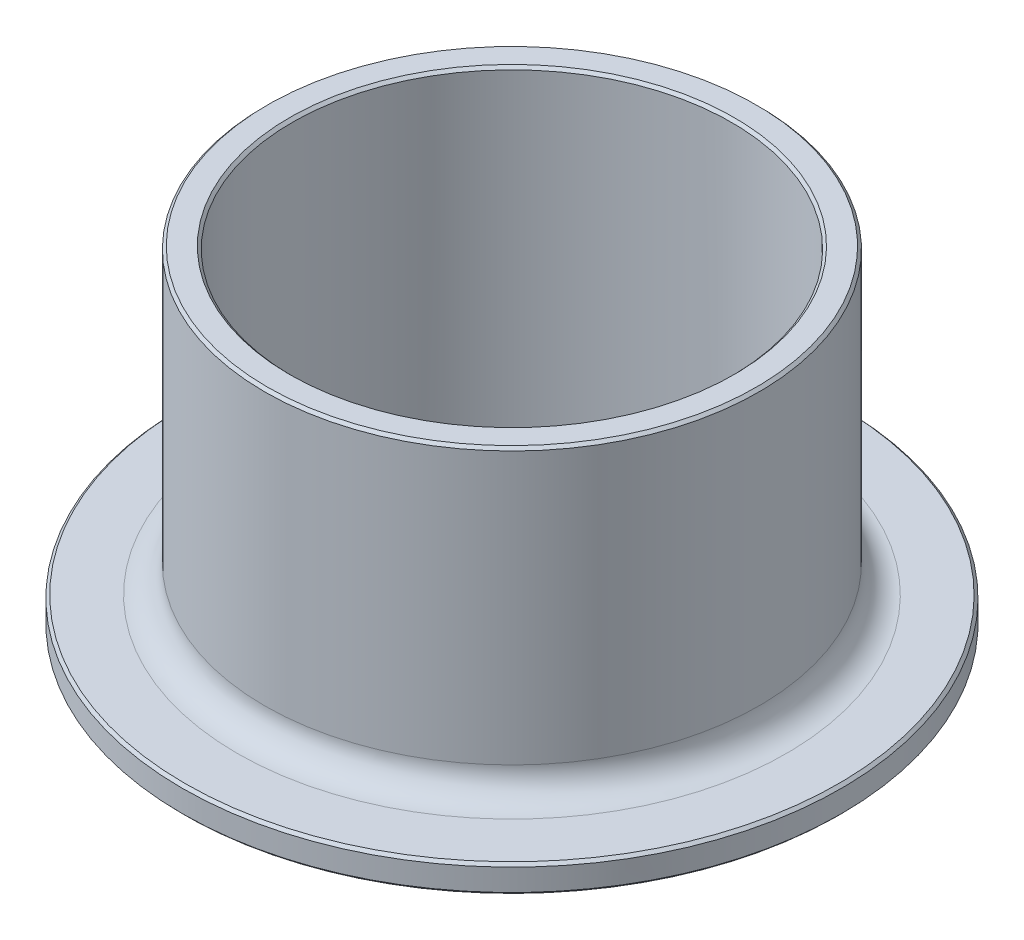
from build123d import *

# Parameters (mm, degrees)
CONG_1_R        = 1
CHANFREIN1_SIZE = 0.1


with BuildPart() as part:
    # Esquisse1 → R_volution1 (revolve)
    with BuildSketch(Plane.XY, mode=Mode.PRIVATE) as r_volution1_sk:
        Polygon((-8, 14.162765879), (-9, 14.162765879), (-9, 3.162765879), (-12, 3.162765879), (-12, 2.162765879), (-8, 2.162765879), align=None)
    revolve(r_volution1_sk.sketch.rotate(Axis((0, 29.244848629, 0), (0, -1, 0)), 270), axis=Axis((0, 29.244848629, 0), (0, -1, 0)))

    # Cong_1
    cong_1_edges = [part.edges().sort_by_distance(p)[0] for p in [
        (0, 3.162765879, -9),
    ]]
    fillet(cong_1_edges, radius=CONG_1_R)

    # Chanfrein1
    chanfrein1_edges = [part.edges().sort_by_distance(p)[0] for p in [
        (0, 14.162765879, -8),
        (0, 14.162765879, -9),
        (0, 3.162765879, -12),
        (0, 2.162765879, -12),
        (0, 2.162765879, -8),
    ]]
    chamfer(chanfrein1_edges, length=CHANFREIN1_SIZE)


solid = part.part
